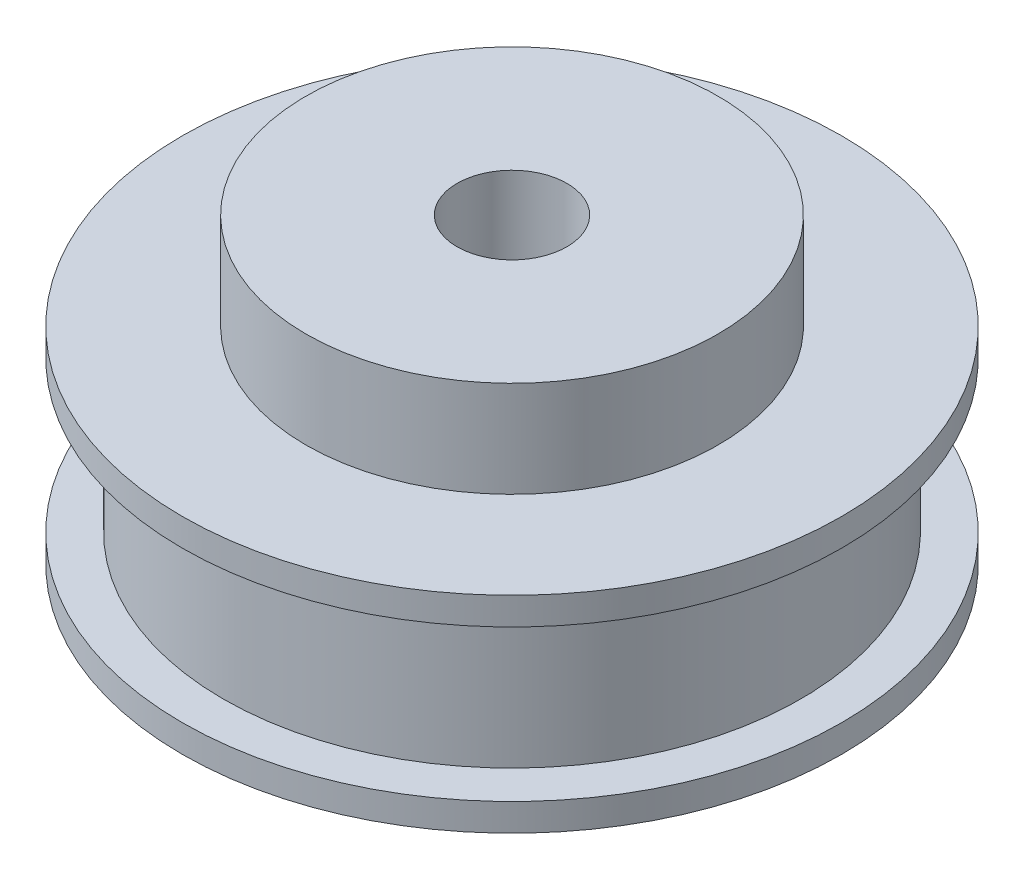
from build123d import *

# Parameters (mm, degrees)
CROQUIS1_R                       = 24
EXTRUIR1_DEPTH                   = 2
CROQUIS2_R                       = 21.02
EXTRUIR2_DEPTH                   = 11
CROQUIS3_R                       = 24
EXTRUIR3_DEPTH                   = 2
CROQUIS11_R                      = 15
EXTRUIR7_DEPTH                   = 7
TALADRO_DE_DI_METRO_DE_8_0_8_1_D = 8


with BuildPart() as part:
    # Croquis1 → Extruir1 (new body)
    with BuildSketch(Plane(origin=(0, 0, 0), x_dir=(1, 0, 0), z_dir=(0, 1, 0))):
        with Locations(Location((0, 0, 0), (0, 0, 270))):
            Circle(CROQUIS1_R)
    extrude(amount=EXTRUIR1_DEPTH)

    # Croquis2 → Extruir2 (add)
    with BuildSketch(Plane(origin=(0, 2, 0), x_dir=(1, 0, 0), z_dir=(0, 1, 0))):
        with Locations(Location((0, 0, 0), (0, 0, 270))):
            Circle(CROQUIS2_R)
    extrude(amount=EXTRUIR2_DEPTH)

    # Croquis3 → Extruir3 (add)
    with BuildSketch(Plane(origin=(0, 13, 0), x_dir=(1, 0, 0), z_dir=(0, 1, 0))):
        with Locations(Location((0, 0, 0), (0, 0, 270))):
            Circle(CROQUIS3_R)
    extrude(amount=EXTRUIR3_DEPTH)

    # Croquis11 → Extruir7 (add)
    with BuildSketch(Plane(origin=(0, 15, 0), x_dir=(1, 0, 0), z_dir=(0, 1, 0))):
        with Locations(Location((0, 0, 0), (0, 0, 270))):
            Circle(CROQUIS11_R)
    extrude(amount=EXTRUIR7_DEPTH)

    # Taladro de di_metro de _8.0 _8_1 (through all)
    with Locations(Plane.ZX.offset(22)):
        with Locations((0, 0)):
            Hole(TALADRO_DE_DI_METRO_DE_8_0_8_1_D / 2)


solid = part.part
